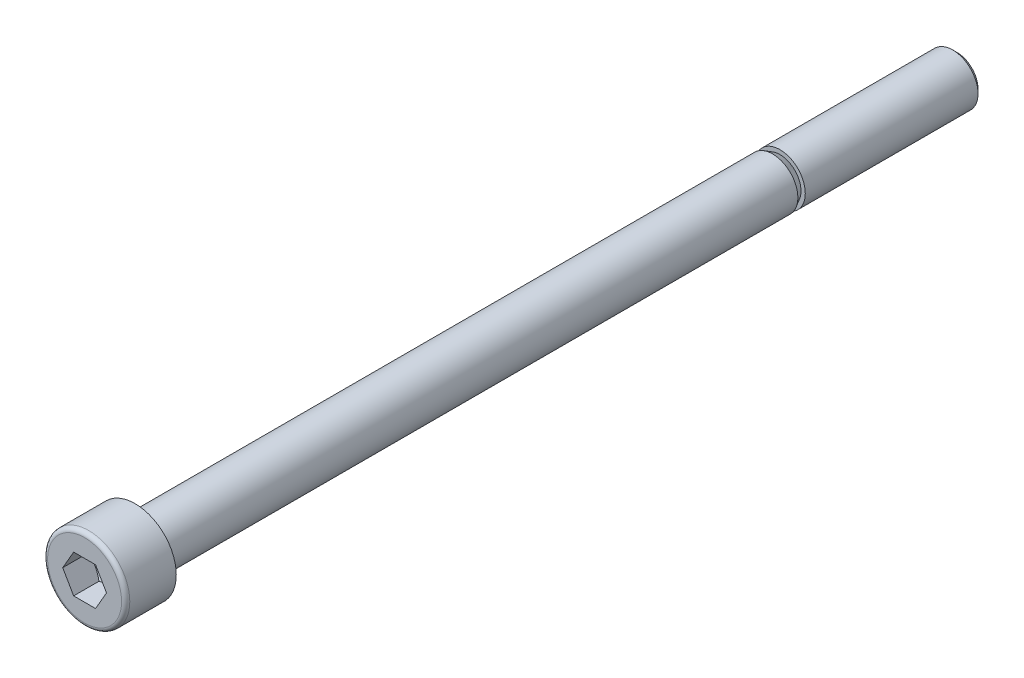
ISO-10303-21;
HEADER;
FILE_DESCRIPTION(('STEP AP214'),'2;1');
FILE_NAME('part.step','',(''),(''),'','','');
FILE_SCHEMA(('AUTOMOTIVE_DESIGN { 1 0 10303 214 1 1 1 1 }'));
ENDSEC;
DATA;
#1=APPLICATION_CONTEXT('core data for automotive mechanical design processes');
#2=APPLICATION_PROTOCOL_DEFINITION('international standard','automotive_design',2000,#1);
#3=PRODUCT_CONTEXT('',#1,'mechanical');
#4=PRODUCT('Part','Part','',(#3));
#5=PRODUCT_RELATED_PRODUCT_CATEGORY('part','',(#4));
#6=PRODUCT_DEFINITION_FORMATION('','',#4);
#7=PRODUCT_DEFINITION_CONTEXT('part definition',#1,'design');
#8=PRODUCT_DEFINITION('design','',#6,#7);
#9=PRODUCT_DEFINITION_SHAPE('','',#8);
#10=(LENGTH_UNIT() NAMED_UNIT(*) SI_UNIT(.MILLI.,.METRE.));
#11=(NAMED_UNIT(*) PLANE_ANGLE_UNIT() SI_UNIT($,.RADIAN.));
#12=(NAMED_UNIT(*) SI_UNIT($,.STERADIAN.) SOLID_ANGLE_UNIT());
#13=UNCERTAINTY_MEASURE_WITH_UNIT(LENGTH_MEASURE(1.E-05),#10,'distance_accuracy_value','');
#14=(GEOMETRIC_REPRESENTATION_CONTEXT(3) GLOBAL_UNCERTAINTY_ASSIGNED_CONTEXT((#13)) GLOBAL_UNIT_ASSIGNED_CONTEXT((#10,
#11,#12)) REPRESENTATION_CONTEXT('',''));
#15=CARTESIAN_POINT('',(0.,0.,0.));
#16=DIRECTION('',(0.,0.,1.));
#17=DIRECTION('',(1.,0.,0.));
#18=AXIS2_PLACEMENT_3D('',#15,#16,#17);
#19=CARTESIAN_POINT('',(0.,0.,8.00000000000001));
#20=DIRECTION('',(0.,0.,0.999999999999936));
#21=DIRECTION('',(1.,0.,0.));
#22=AXIS2_PLACEMENT_3D('',#19,#20,#21);
#23=PLANE('',#22);
#24=CARTESIAN_POINT('',(0.,0.,8.00000000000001));
#25=DIRECTION('',(0.,0.,0.999999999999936));
#26=DIRECTION('',(1.,0.,0.));
#27=AXIS2_PLACEMENT_3D('',#24,#25,#26);
#28=CIRCLE('',#27,5.85);
#29=CARTESIAN_POINT('',(5.85000000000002,0.,8.00000000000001));
#30=VERTEX_POINT('',#29);
#31=EDGE_CURVE('E13',#30,#30,#28,.T.);
#32=ORIENTED_EDGE('',*,*,#31,.T.);
#33=EDGE_LOOP('',(#32));
#34=FACE_BOUND('',#33,.T.);
#35=DIRECTION('',(1.,0.,0.));
#36=VECTOR('',#35,1.);
#37=CARTESIAN_POINT('',(-1.73204999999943,2.99999860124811,8.00000000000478));
#38=LINE('',#37,#36);
#39=CARTESIAN_POINT('',(-1.73204999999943,2.99999860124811,8.00000000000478));
#40=VERTEX_POINT('',#39);
#41=CARTESIAN_POINT('',(1.73205000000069,2.99999860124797,7.99999999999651));
#42=VERTEX_POINT('',#41);
#43=EDGE_CURVE('E100',#40,#42,#38,.T.);
#44=ORIENTED_EDGE('',*,*,#43,.T.);
#45=DIRECTION('',(0.5,-0.866025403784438,0.));
#46=VECTOR('',#45,1.);
#47=CARTESIAN_POINT('',(1.73205000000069,2.99999860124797,7.99999999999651));
#48=LINE('',#47,#46);
#49=CARTESIAN_POINT('',(3.46410000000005,-2.35922392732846E-13,8.00000000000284));
#50=VERTEX_POINT('',#49);
#51=EDGE_CURVE('E39',#42,#50,#48,.T.);
#52=ORIENTED_EDGE('',*,*,#51,.T.);
#53=DIRECTION('',(-0.500000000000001,-0.86602540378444,0.));
#54=VECTOR('',#53,1.);
#55=CARTESIAN_POINT('',(3.46410000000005,-2.35922392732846E-13,8.00000000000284));
#56=LINE('',#55,#54);
#57=CARTESIAN_POINT('',(1.73205000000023,-2.99999860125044,8.00000000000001));
#58=VERTEX_POINT('',#57);
#59=EDGE_CURVE('E177',#50,#58,#56,.T.);
#60=ORIENTED_EDGE('',*,*,#59,.T.);
#61=DIRECTION('',(-1.,0.,0.));
#62=VECTOR('',#61,1.);
#63=CARTESIAN_POINT('',(1.73205000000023,-2.99999860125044,8.00000000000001));
#64=LINE('',#63,#62);
#65=CARTESIAN_POINT('',(-1.73205000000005,-2.99999860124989,8.00000000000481));
#66=VERTEX_POINT('',#65);
#67=EDGE_CURVE('E173',#58,#66,#64,.T.);
#68=ORIENTED_EDGE('',*,*,#67,.T.);
#69=DIRECTION('',(-0.5,0.866025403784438,0.));
#70=VECTOR('',#69,1.);
#71=CARTESIAN_POINT('',(-1.73205000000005,-2.99999860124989,8.00000000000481));
#72=LINE('',#71,#70);
#73=CARTESIAN_POINT('',(-3.46410000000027,0.,7.99999999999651));
#74=VERTEX_POINT('',#73);
#75=EDGE_CURVE('E168',#66,#74,#72,.T.);
#76=ORIENTED_EDGE('',*,*,#75,.T.);
#77=DIRECTION('',(0.500000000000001,0.86602540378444,0.));
#78=VECTOR('',#77,1.);
#79=CARTESIAN_POINT('',(-3.46410000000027,0.,7.99999999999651));
#80=LINE('',#79,#78);
#81=EDGE_CURVE('E104',#74,#40,#80,.T.);
#82=ORIENTED_EDGE('',*,*,#81,.T.);
#83=EDGE_LOOP('',(#44,#52,#60,#68,#76,#82));
#84=FACE_BOUND('',#83,.T.);
#85=ADVANCED_FACE('F25',(#34,#84),#23,.T.);
#86=CARTESIAN_POINT('',(-1.11022302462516E-13,-4.71844785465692E-13,7.35));
#87=DIRECTION('',(0.,0.,0.999999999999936));
#88=DIRECTION('',(1.,0.,0.));
#89=AXIS2_PLACEMENT_3D('',#86,#87,#88);
#90=TOROIDAL_SURFACE('',#89,5.85,0.65);
#91=ORIENTED_EDGE('',*,*,#31,.F.);
#92=EDGE_LOOP('',(#91));
#93=FACE_BOUND('',#92,.T.);
#94=CARTESIAN_POINT('',(-1.11022302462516E-13,-4.71844785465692E-13,7.35));
#95=DIRECTION('',(0.,0.,0.999999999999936));
#96=DIRECTION('',(1.,0.,0.));
#97=AXIS2_PLACEMENT_3D('',#94,#95,#96);
#98=CIRCLE('',#97,6.5);
#99=CARTESIAN_POINT('',(6.50000000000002,0.,7.35));
#100=VERTEX_POINT('',#99);
#101=EDGE_CURVE('E32',#100,#100,#98,.T.);
#102=ORIENTED_EDGE('',*,*,#101,.T.);
#103=EDGE_LOOP('',(#102));
#104=FACE_BOUND('',#103,.T.);
#105=ADVANCED_FACE('F141',(#93,#104),#90,.T.);
#106=CARTESIAN_POINT('',(0.,0.,8.00000000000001));
#107=DIRECTION('',(0.,0.,0.999999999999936));
#108=DIRECTION('',(1.,0.,0.));
#109=AXIS2_PLACEMENT_3D('',#106,#107,#108);
#110=CYLINDRICAL_SURFACE('',#109,6.5);
#111=CARTESIAN_POINT('',(0.,0.,0.));
#112=DIRECTION('',(0.,0.,0.999999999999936));
#113=DIRECTION('',(1.,0.,0.));
#114=AXIS2_PLACEMENT_3D('',#111,#112,#113);
#115=CIRCLE('',#114,6.5);
#116=CARTESIAN_POINT('',(6.50000000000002,0.,0.));
#117=VERTEX_POINT('',#116);
#118=EDGE_CURVE('E136',#117,#117,#115,.T.);
#119=CARTESIAN_POINT('',(6.50000000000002,0.,0.));
#120=CARTESIAN_POINT('',(6.50000000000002,0.,0.0765625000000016));
#121=CARTESIAN_POINT('',(6.50000000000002,0.,0.153125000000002));
#122=CARTESIAN_POINT('',(6.50000000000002,0.,0.306250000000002));
#123=CARTESIAN_POINT('',(6.50000000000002,0.,0.382812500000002));
#124=CARTESIAN_POINT('',(6.50000000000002,0.,0.535937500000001));
#125=CARTESIAN_POINT('',(6.50000000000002,0.,0.612500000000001));
#126=CARTESIAN_POINT('',(6.50000000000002,0.,0.765625));
#127=CARTESIAN_POINT('',(6.50000000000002,0.,0.8421875));
#128=CARTESIAN_POINT('',(6.50000000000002,0.,0.9953125));
#129=CARTESIAN_POINT('',(6.50000000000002,0.,1.071875));
#130=CARTESIAN_POINT('',(6.50000000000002,0.,1.225));
#131=CARTESIAN_POINT('',(6.50000000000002,0.,1.3015625));
#132=CARTESIAN_POINT('',(6.50000000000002,0.,1.4546875));
#133=CARTESIAN_POINT('',(6.50000000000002,0.,1.53125));
#134=CARTESIAN_POINT('',(6.50000000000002,0.,1.684375));
#135=CARTESIAN_POINT('',(6.50000000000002,0.,1.7609375));
#136=CARTESIAN_POINT('',(6.50000000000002,0.,1.9140625));
#137=CARTESIAN_POINT('',(6.50000000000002,0.,1.990625));
#138=CARTESIAN_POINT('',(6.50000000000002,0.,2.14375));
#139=CARTESIAN_POINT('',(6.50000000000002,0.,2.2203125));
#140=CARTESIAN_POINT('',(6.50000000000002,0.,2.3734375));
#141=CARTESIAN_POINT('',(6.50000000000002,0.,2.45));
#142=CARTESIAN_POINT('',(6.50000000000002,0.,2.603125));
#143=CARTESIAN_POINT('',(6.50000000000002,0.,2.6796875));
#144=CARTESIAN_POINT('',(6.50000000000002,0.,2.8328125));
#145=CARTESIAN_POINT('',(6.50000000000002,0.,2.909375));
#146=CARTESIAN_POINT('',(6.50000000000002,0.,3.0625));
#147=CARTESIAN_POINT('',(6.50000000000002,0.,3.1390625));
#148=CARTESIAN_POINT('',(6.50000000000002,0.,3.2921875));
#149=CARTESIAN_POINT('',(6.50000000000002,0.,3.36875));
#150=CARTESIAN_POINT('',(6.50000000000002,0.,3.521875));
#151=CARTESIAN_POINT('',(6.50000000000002,0.,3.5984375));
#152=CARTESIAN_POINT('',(6.50000000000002,0.,3.7515625));
#153=CARTESIAN_POINT('',(6.50000000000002,0.,3.828125));
#154=CARTESIAN_POINT('',(6.50000000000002,0.,3.98125));
#155=CARTESIAN_POINT('',(6.50000000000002,0.,4.0578125));
#156=CARTESIAN_POINT('',(6.50000000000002,0.,4.2109375));
#157=CARTESIAN_POINT('',(6.50000000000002,0.,4.2875));
#158=CARTESIAN_POINT('',(6.50000000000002,0.,4.440625));
#159=CARTESIAN_POINT('',(6.50000000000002,0.,4.5171875));
#160=CARTESIAN_POINT('',(6.50000000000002,0.,4.6703125));
#161=CARTESIAN_POINT('',(6.50000000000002,0.,4.746875));
#162=CARTESIAN_POINT('',(6.50000000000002,0.,4.9));
#163=CARTESIAN_POINT('',(6.50000000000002,0.,4.9765625));
#164=CARTESIAN_POINT('',(6.50000000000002,0.,5.1296875));
#165=CARTESIAN_POINT('',(6.50000000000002,0.,5.20625));
#166=CARTESIAN_POINT('',(6.50000000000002,0.,5.359375));
#167=CARTESIAN_POINT('',(6.50000000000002,0.,5.4359375));
#168=CARTESIAN_POINT('',(6.50000000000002,0.,5.5890625));
#169=CARTESIAN_POINT('',(6.50000000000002,0.,5.665625));
#170=CARTESIAN_POINT('',(6.50000000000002,0.,5.81875));
#171=CARTESIAN_POINT('',(6.50000000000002,0.,5.8953125));
#172=CARTESIAN_POINT('',(6.50000000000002,0.,6.0484375));
#173=CARTESIAN_POINT('',(6.50000000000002,0.,6.125));
#174=CARTESIAN_POINT('',(6.50000000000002,0.,6.278125));
#175=CARTESIAN_POINT('',(6.50000000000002,0.,6.3546875));
#176=CARTESIAN_POINT('',(6.50000000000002,0.,6.5078125));
#177=CARTESIAN_POINT('',(6.50000000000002,0.,6.584375));
#178=CARTESIAN_POINT('',(6.50000000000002,0.,6.7375));
#179=CARTESIAN_POINT('',(6.50000000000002,0.,6.8140625));
#180=CARTESIAN_POINT('',(6.50000000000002,0.,6.9671875));
#181=CARTESIAN_POINT('',(6.50000000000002,0.,7.04375));
#182=CARTESIAN_POINT('',(6.50000000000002,0.,7.196875));
#183=CARTESIAN_POINT('',(6.50000000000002,0.,7.2734375));
#184=CARTESIAN_POINT('',(6.50000000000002,0.,7.35));
#185=B_SPLINE_CURVE_WITH_KNOTS('',3,(#119,#120,#121,#122,#123,#124,#125,#126,#127,#128,#129,
#130,#131,#132,#133,#134,#135,#136,#137,#138,#139,#140,#141,#142,#143,#144,#145,#146,#147,#148,
#149,#150,#151,#152,#153,#154,#155,#156,#157,#158,#159,#160,#161,#162,#163,#164,#165,#166,#167,
#168,#169,#170,#171,#172,#173,#174,#175,#176,#177,#178,#179,#180,#181,#182,#183,#184),
.UNSPECIFIED.,.F.,.F.,(4,2,2,2,2,2,2,2,2,2,2,2,2,2,2,2,2,2,2,2,2,2,2,2,2,2,2,2,2,2,2,2,4),(0.,
0.2296875,0.459375,0.689062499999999,0.918749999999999,1.1484375,1.378125,1.6078125,1.8375,
2.0671875,2.296875,2.5265625,2.75625,2.9859375,3.215625,3.4453125,3.675,3.9046875,4.134375,
4.3640625,4.59375,4.8234375,5.053125,5.2828125,5.5125,5.7421875,5.97187499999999,6.2015625,
6.43125,6.66093749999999,6.89062499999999,7.12031249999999,7.34999999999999),.UNSPECIFIED.);
#186=EDGE_CURVE('BSEAM143',#117,#100,#185,.T.);
#187=ORIENTED_EDGE('',*,*,#118,.T.);
#188=ORIENTED_EDGE('',*,*,#101,.F.);
#189=ORIENTED_EDGE('',*,*,#186,.T.);
#190=ORIENTED_EDGE('',*,*,#186,.F.);
#191=EDGE_LOOP('',(#187,#189,#188,#190));
#192=FACE_BOUND('',#191,.T.);
#193=ADVANCED_FACE('F143',(#192),#110,.T.);
#194=CARTESIAN_POINT('',(-1.38777878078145E-13,6.49999999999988,0.));
#195=DIRECTION('',(0.,0.,-0.999999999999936));
#196=DIRECTION('',(-1.,0.,0.));
#197=AXIS2_PLACEMENT_3D('',#194,#195,#196);
#198=PLANE('',#197);
#199=CARTESIAN_POINT('',(0.,0.,0.));
#200=DIRECTION('',(0.,0.,0.999999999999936));
#201=DIRECTION('',(1.,0.,0.));
#202=AXIS2_PLACEMENT_3D('',#199,#200,#201);
#203=CIRCLE('',#202,4.4);
#204=CARTESIAN_POINT('',(4.4,0.,0.));
#205=VERTEX_POINT('',#204);
#206=EDGE_CURVE('E133',#205,#205,#203,.T.);
#207=ORIENTED_EDGE('',*,*,#206,.T.);
#208=EDGE_LOOP('',(#207));
#209=FACE_BOUND('',#208,.T.);
#210=ORIENTED_EDGE('',*,*,#118,.F.);
#211=EDGE_LOOP('',(#210));
#212=FACE_BOUND('',#211,.T.);
#213=ADVANCED_FACE('F145',(#209,#212),#198,.T.);
#214=CARTESIAN_POINT('',(0.,0.,-0.400000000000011));
#215=DIRECTION('',(0.,0.,0.999999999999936));
#216=DIRECTION('',(1.,0.,0.));
#217=AXIS2_PLACEMENT_3D('',#214,#215,#216);
#218=TOROIDAL_SURFACE('',#217,4.4,0.4);
#219=CARTESIAN_POINT('',(0.,0.,-0.400000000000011));
#220=DIRECTION('',(0.,0.,0.999999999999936));
#221=DIRECTION('',(1.,0.,0.));
#222=AXIS2_PLACEMENT_3D('',#219,#220,#221);
#223=CIRCLE('',#222,4.);
#224=CARTESIAN_POINT('',(4.00000000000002,0.,-0.400000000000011));
#225=VERTEX_POINT('',#224);
#226=EDGE_CURVE('E130',#225,#225,#223,.T.);
#227=ORIENTED_EDGE('',*,*,#226,.T.);
#228=EDGE_LOOP('',(#227));
#229=FACE_BOUND('',#228,.T.);
#230=ORIENTED_EDGE('',*,*,#206,.F.);
#231=EDGE_LOOP('',(#230));
#232=FACE_BOUND('',#231,.T.);
#233=ADVANCED_FACE('F153',(#229,#232),#218,.F.);
#234=CARTESIAN_POINT('',(0.,0.,8.00000000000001));
#235=DIRECTION('',(0.,0.,0.999999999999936));
#236=DIRECTION('',(1.,0.,0.));
#237=AXIS2_PLACEMENT_3D('',#234,#235,#236);
#238=CYLINDRICAL_SURFACE('',#237,4.);
#239=CARTESIAN_POINT('',(-2.08166817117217E-13,-6.80011602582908E-13,-100.828159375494));
#240=DIRECTION('',(0.,0.,0.999999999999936));
#241=DIRECTION('',(1.,0.,0.));
#242=AXIS2_PLACEMENT_3D('',#239,#240,#241);
#243=CIRCLE('',#242,4.);
#244=CARTESIAN_POINT('',(4.00000000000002,0.,-100.828159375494));
#245=VERTEX_POINT('',#244);
#246=EDGE_CURVE('E127',#245,#245,#243,.T.);
#247=CARTESIAN_POINT('',(4.00000000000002,0.,-100.828159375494));
#248=CARTESIAN_POINT('',(4.00000000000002,0.,-99.7820327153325));
#249=CARTESIAN_POINT('',(4.00000000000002,0.,-98.7359060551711));
#250=CARTESIAN_POINT('',(4.00000000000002,0.,-96.6436527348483));
#251=CARTESIAN_POINT('',(4.00000000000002,0.,-95.5975260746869));
#252=CARTESIAN_POINT('',(4.00000000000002,0.,-93.5052727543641));
#253=CARTESIAN_POINT('',(4.00000000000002,0.,-92.4591460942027));
#254=CARTESIAN_POINT('',(4.00000000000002,0.,-90.3668927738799));
#255=CARTESIAN_POINT('',(4.00000000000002,0.,-89.3207661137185));
#256=CARTESIAN_POINT('',(4.00000000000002,0.,-87.2285127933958));
#257=CARTESIAN_POINT('',(4.00000000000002,0.,-86.1823861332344));
#258=CARTESIAN_POINT('',(4.00000000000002,0.,-84.0901328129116));
#259=CARTESIAN_POINT('',(4.00000000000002,0.,-83.0440061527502));
#260=CARTESIAN_POINT('',(4.00000000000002,0.,-80.9517528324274));
#261=CARTESIAN_POINT('',(4.00000000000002,0.,-79.905626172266));
#262=CARTESIAN_POINT('',(4.00000000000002,0.,-77.8133728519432));
#263=CARTESIAN_POINT('',(4.00000000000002,0.,-76.7672461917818));
#264=CARTESIAN_POINT('',(4.00000000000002,0.,-74.674992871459));
#265=CARTESIAN_POINT('',(4.00000000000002,0.,-73.6288662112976));
#266=CARTESIAN_POINT('',(4.00000000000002,0.,-71.5366128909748));
#267=CARTESIAN_POINT('',(4.00000000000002,0.,-70.4904862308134));
#268=CARTESIAN_POINT('',(4.00000000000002,0.,-68.3982329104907));
#269=CARTESIAN_POINT('',(4.00000000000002,0.,-67.3521062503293));
#270=CARTESIAN_POINT('',(4.00000000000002,0.,-65.2598529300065));
#271=CARTESIAN_POINT('',(4.00000000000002,0.,-64.2137262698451));
#272=CARTESIAN_POINT('',(4.00000000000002,0.,-62.1214729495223));
#273=CARTESIAN_POINT('',(4.00000000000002,0.,-61.0753462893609));
#274=CARTESIAN_POINT('',(4.00000000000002,0.,-58.9830929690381));
#275=CARTESIAN_POINT('',(4.00000000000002,0.,-57.9369663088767));
#276=CARTESIAN_POINT('',(4.00000000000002,0.,-55.8447129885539));
#277=CARTESIAN_POINT('',(4.00000000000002,0.,-54.7985863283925));
#278=CARTESIAN_POINT('',(4.00000000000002,0.,-52.7063330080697));
#279=CARTESIAN_POINT('',(4.00000000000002,0.,-51.6602063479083));
#280=CARTESIAN_POINT('',(4.00000000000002,0.,-49.5679530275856));
#281=CARTESIAN_POINT('',(4.00000000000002,0.,-48.5218263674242));
#282=CARTESIAN_POINT('',(4.00000000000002,0.,-46.4295730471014));
#283=CARTESIAN_POINT('',(4.00000000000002,0.,-45.38344638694));
#284=CARTESIAN_POINT('',(4.00000000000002,0.,-43.2911930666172));
#285=CARTESIAN_POINT('',(4.00000000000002,0.,-42.2450664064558));
#286=CARTESIAN_POINT('',(4.00000000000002,0.,-40.152813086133));
#287=CARTESIAN_POINT('',(4.00000000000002,0.,-39.1066864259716));
#288=CARTESIAN_POINT('',(4.00000000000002,0.,-37.0144331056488));
#289=CARTESIAN_POINT('',(4.00000000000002,0.,-35.9683064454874));
#290=CARTESIAN_POINT('',(4.00000000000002,0.,-33.8760531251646));
#291=CARTESIAN_POINT('',(4.00000000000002,0.,-32.8299264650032));
#292=CARTESIAN_POINT('',(4.00000000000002,0.,-30.7376731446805));
#293=CARTESIAN_POINT('',(4.00000000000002,0.,-29.6915464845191));
#294=CARTESIAN_POINT('',(4.00000000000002,0.,-27.5992931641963));
#295=CARTESIAN_POINT('',(4.00000000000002,0.,-26.5531665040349));
#296=CARTESIAN_POINT('',(4.00000000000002,0.,-24.4609131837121));
#297=CARTESIAN_POINT('',(4.00000000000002,0.,-23.4147865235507));
#298=CARTESIAN_POINT('',(4.00000000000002,0.,-21.3225332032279));
#299=CARTESIAN_POINT('',(4.00000000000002,0.,-20.2764065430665));
#300=CARTESIAN_POINT('',(4.00000000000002,0.,-18.1841532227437));
#301=CARTESIAN_POINT('',(4.00000000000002,0.,-17.1380265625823));
#302=CARTESIAN_POINT('',(4.00000000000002,0.,-15.0457732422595));
#303=CARTESIAN_POINT('',(4.00000000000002,0.,-13.9996465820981));
#304=CARTESIAN_POINT('',(4.00000000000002,0.,-11.9073932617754));
#305=CARTESIAN_POINT('',(4.00000000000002,0.,-10.861266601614));
#306=CARTESIAN_POINT('',(4.00000000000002,0.,-8.76901328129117));
#307=CARTESIAN_POINT('',(4.00000000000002,0.,-7.72288662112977));
#308=CARTESIAN_POINT('',(4.00000000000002,0.,-5.63063330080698));
#309=CARTESIAN_POINT('',(4.00000000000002,0.,-4.58450664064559));
#310=CARTESIAN_POINT('',(4.00000000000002,0.,-2.4922533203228));
#311=CARTESIAN_POINT('',(4.00000000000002,0.,-1.4461266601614));
#312=CARTESIAN_POINT('',(4.00000000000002,0.,-0.400000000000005));
#313=B_SPLINE_CURVE_WITH_KNOTS('',3,(#247,#248,#249,#250,#251,#252,#253,#254,#255,#256,#257,
#258,#259,#260,#261,#262,#263,#264,#265,#266,#267,#268,#269,#270,#271,#272,#273,#274,#275,#276,
#277,#278,#279,#280,#281,#282,#283,#284,#285,#286,#287,#288,#289,#290,#291,#292,#293,#294,#295,
#296,#297,#298,#299,#300,#301,#302,#303,#304,#305,#306,#307,#308,#309,#310,#311,#312),
.UNSPECIFIED.,.F.,.F.,(4,2,2,2,2,2,2,2,2,2,2,2,2,2,2,2,2,2,2,2,2,2,2,2,2,2,2,2,2,2,2,2,4),(0.,
3.13837998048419,6.27675996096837,9.41513994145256,12.5535199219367,15.6918999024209,
18.8302798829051,21.9686598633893,25.1070398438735,28.2454198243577,31.3837998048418,
34.522179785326,37.6605597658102,40.7989397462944,43.9373197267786,47.0756997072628,
50.2140796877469,53.3524596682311,56.4908396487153,59.6292196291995,62.7675996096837,
65.9059795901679,69.044359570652,72.1827395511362,75.3211195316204,78.4594995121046,
81.5978794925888,84.736259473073,87.8746394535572,91.0130194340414,94.1513994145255,
97.2897793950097,100.428159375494),.UNSPECIFIED.);
#314=EDGE_CURVE('BSEAM276',#245,#225,#313,.T.);
#315=ORIENTED_EDGE('',*,*,#246,.T.);
#316=ORIENTED_EDGE('',*,*,#226,.F.);
#317=ORIENTED_EDGE('',*,*,#314,.T.);
#318=ORIENTED_EDGE('',*,*,#314,.F.);
#319=EDGE_LOOP('',(#315,#317,#316,#318));
#320=FACE_BOUND('',#319,.T.);
#321=ADVANCED_FACE('F276',(#320),#238,.T.);
#322=CARTESIAN_POINT('',(-2.08166817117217E-13,-6.80011602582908E-13,-100.828159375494));
#323=DIRECTION('',(0.,0.,0.999999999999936));
#324=DIRECTION('',(1.,0.,0.));
#325=AXIS2_PLACEMENT_3D('',#322,#323,#324);
#326=CONICAL_SURFACE('',#325,4.,0.523598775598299);
#327=CARTESIAN_POINT('',(4.71844785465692E-13,-1.20736753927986E-12,-101.99999999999));
#328=DIRECTION('',(0.,0.,0.999999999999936));
#329=DIRECTION('',(1.,0.,0.));
#330=AXIS2_PLACEMENT_3D('',#327,#328,#329);
#331=CIRCLE('',#330,3.3234375);
#332=CARTESIAN_POINT('',(3.32343749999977,-6.77982236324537E-13,-101.99999999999));
#333=VERTEX_POINT('',#332);
#334=EDGE_CURVE('E124',#333,#333,#331,.T.);
#335=CARTESIAN_POINT('',(3.32343749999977,-6.77982236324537E-13,-101.99999999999));
#336=CARTESIAN_POINT('',(3.33048502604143,-6.77977932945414E-13,-101.987793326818));
#337=CARTESIAN_POINT('',(3.3375325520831,-6.77973629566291E-13,-101.975586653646));
#338=CARTESIAN_POINT('',(3.35162760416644,-6.77965022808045E-13,-101.951173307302));
#339=CARTESIAN_POINT('',(3.35867513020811,-6.77960719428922E-13,-101.938966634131));
#340=CARTESIAN_POINT('',(3.37277018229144,-6.77952112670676E-13,-101.914553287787));
#341=CARTESIAN_POINT('',(3.3798177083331,-6.77947809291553E-13,-101.902346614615));
#342=CARTESIAN_POINT('',(3.39391276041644,-6.77939202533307E-13,-101.877933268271));
#343=CARTESIAN_POINT('',(3.40096028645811,-6.77934899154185E-13,-101.8657265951));
#344=CARTESIAN_POINT('',(3.41505533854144,-6.77926292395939E-13,-101.841313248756));
#345=CARTESIAN_POINT('',(3.4221028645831,-6.77921989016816E-13,-101.829106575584));
#346=CARTESIAN_POINT('',(3.43619791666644,-6.7791338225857E-13,-101.80469322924));
#347=CARTESIAN_POINT('',(3.44324544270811,-6.77909078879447E-13,-101.792486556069));
#348=CARTESIAN_POINT('',(3.45734049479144,-6.77900472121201E-13,-101.768073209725));
#349=CARTESIAN_POINT('',(3.46438802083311,-6.77896168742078E-13,-101.755866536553));
#350=CARTESIAN_POINT('',(3.47848307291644,-6.77887561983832E-13,-101.731453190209));
#351=CARTESIAN_POINT('',(3.48553059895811,-6.77883258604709E-13,-101.719246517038));
#352=CARTESIAN_POINT('',(3.49962565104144,-6.77874651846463E-13,-101.694833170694));
#353=CARTESIAN_POINT('',(3.50667317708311,-6.7787034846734E-13,-101.682626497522));
#354=CARTESIAN_POINT('',(3.52076822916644,-6.77861741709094E-13,-101.658213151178));
#355=CARTESIAN_POINT('',(3.52781575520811,-6.77857438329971E-13,-101.646006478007));
#356=CARTESIAN_POINT('',(3.54191080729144,-6.77848831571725E-13,-101.621593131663));
#357=CARTESIAN_POINT('',(3.54895833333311,-6.77844528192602E-13,-101.609386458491));
#358=CARTESIAN_POINT('',(3.56305338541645,-6.77835921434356E-13,-101.584973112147));
#359=CARTESIAN_POINT('',(3.57010091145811,-6.77831618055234E-13,-101.572766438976));
#360=CARTESIAN_POINT('',(3.58419596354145,-6.77823011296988E-13,-101.548353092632));
#361=CARTESIAN_POINT('',(3.59124348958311,-6.77818707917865E-13,-101.53614641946));
#362=CARTESIAN_POINT('',(3.60533854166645,-6.77810101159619E-13,-101.511733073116));
#363=CARTESIAN_POINT('',(3.61238606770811,-6.77805797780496E-13,-101.499526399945));
#364=CARTESIAN_POINT('',(3.62648111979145,-6.7779719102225E-13,-101.475113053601));
#365=CARTESIAN_POINT('',(3.63352864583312,-6.77792887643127E-13,-101.462906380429));
#366=CARTESIAN_POINT('',(3.64762369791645,-6.77784280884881E-13,-101.438493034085));
#367=CARTESIAN_POINT('',(3.65467122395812,-6.77779977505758E-13,-101.426286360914));
#368=CARTESIAN_POINT('',(3.66876627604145,-6.77771370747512E-13,-101.40187301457));
#369=CARTESIAN_POINT('',(3.67581380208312,-6.77767067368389E-13,-101.389666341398));
#370=CARTESIAN_POINT('',(3.68990885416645,-6.77758460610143E-13,-101.365252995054));
#371=CARTESIAN_POINT('',(3.69695638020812,-6.7775415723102E-13,-101.353046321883));
#372=CARTESIAN_POINT('',(3.71105143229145,-6.77745550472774E-13,-101.328632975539));
#373=CARTESIAN_POINT('',(3.71809895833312,-6.77741247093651E-13,-101.316426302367));
#374=CARTESIAN_POINT('',(3.73219401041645,-6.77732640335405E-13,-101.292012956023));
#375=CARTESIAN_POINT('',(3.73924153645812,-6.77728336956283E-13,-101.279806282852));
#376=CARTESIAN_POINT('',(3.75333658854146,-6.77719730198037E-13,-101.255392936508));
#377=CARTESIAN_POINT('',(3.76038411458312,-6.77715426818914E-13,-101.243186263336));
#378=CARTESIAN_POINT('',(3.77447916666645,-6.77706820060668E-13,-101.218772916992));
#379=CARTESIAN_POINT('',(3.78152669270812,-6.77702516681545E-13,-101.206566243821));
#380=CARTESIAN_POINT('',(3.79562174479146,-6.77693909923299E-13,-101.182152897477));
#381=CARTESIAN_POINT('',(3.80266927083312,-6.77689606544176E-13,-101.169946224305));
#382=CARTESIAN_POINT('',(3.81676432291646,-6.7768099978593E-13,-101.145532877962));
#383=CARTESIAN_POINT('',(3.82381184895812,-6.77676696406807E-13,-101.13332620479));
#384=CARTESIAN_POINT('',(3.83790690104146,-6.77668089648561E-13,-101.108912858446));
#385=CARTESIAN_POINT('',(3.84495442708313,-6.77663786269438E-13,-101.096706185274));
#386=CARTESIAN_POINT('',(3.85904947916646,-6.77655179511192E-13,-101.072292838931));
#387=CARTESIAN_POINT('',(3.86609700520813,-6.77650876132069E-13,-101.060086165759));
#388=CARTESIAN_POINT('',(3.88019205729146,-6.77642269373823E-13,-101.035672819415));
#389=CARTESIAN_POINT('',(3.88723958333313,-6.776379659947E-13,-101.023466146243));
#390=CARTESIAN_POINT('',(3.90133463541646,-6.77629359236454E-13,-100.9990527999));
#391=CARTESIAN_POINT('',(3.90838216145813,-6.77625055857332E-13,-100.986846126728));
#392=CARTESIAN_POINT('',(3.92247721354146,-6.77616449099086E-13,-100.962432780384));
#393=CARTESIAN_POINT('',(3.92952473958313,-6.77612145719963E-13,-100.950226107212));
#394=CARTESIAN_POINT('',(3.94361979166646,-6.77603538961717E-13,-100.925812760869));
#395=CARTESIAN_POINT('',(3.95066731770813,-6.77599235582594E-13,-100.913606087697));
#396=CARTESIAN_POINT('',(3.96476236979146,-6.77590628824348E-13,-100.889192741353));
#397=CARTESIAN_POINT('',(3.97180989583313,-6.77586325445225E-13,-100.876986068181));
#398=CARTESIAN_POINT('',(3.98590494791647,-6.77577718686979E-13,-100.852572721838));
#399=CARTESIAN_POINT('',(3.99295247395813,-6.77573415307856E-13,-100.840366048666));
#400=CARTESIAN_POINT('',(3.9999999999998,-6.77569111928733E-13,-100.828159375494));
#401=B_SPLINE_CURVE_WITH_KNOTS('',3,(#335,#336,#337,#338,#339,#340,#341,#342,#343,#344,#345,
#346,#347,#348,#349,#350,#351,#352,#353,#354,#355,#356,#357,#358,#359,#360,#361,#362,#363,#364,
#365,#366,#367,#368,#369,#370,#371,#372,#373,#374,#375,#376,#377,#378,#379,#380,#381,#382,#383,
#384,#385,#386,#387,#388,#389,#390,#391,#392,#393,#394,#395,#396,#397,#398,#399,#400),
.UNSPECIFIED.,.F.,.F.,(4,2,2,2,2,2,2,2,2,2,2,2,2,2,2,2,2,2,2,2,2,2,2,2,2,2,2,2,2,2,2,2,4),(0.,
0.0422851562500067,0.0845703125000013,0.126855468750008,0.169140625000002,0.211425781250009,
0.253710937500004,0.29599609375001,0.338281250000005,0.38056640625,0.422851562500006,
0.465136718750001,0.507421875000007,0.549707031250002,0.591992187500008,0.634277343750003,
0.676562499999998,0.718847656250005,0.761132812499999,0.803417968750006,0.845703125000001,
0.887988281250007,0.930273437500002,0.972558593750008,1.01484375,1.05712890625,1.0994140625,
1.14169921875,1.18398437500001,1.22626953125,1.26855468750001,1.31083984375,1.353125),.UNSPECIFIED.);
#402=EDGE_CURVE('BSEAM272',#333,#245,#401,.T.);
#403=ORIENTED_EDGE('',*,*,#334,.T.);
#404=ORIENTED_EDGE('',*,*,#246,.F.);
#405=ORIENTED_EDGE('',*,*,#402,.T.);
#406=ORIENTED_EDGE('',*,*,#402,.F.);
#407=EDGE_LOOP('',(#403,#405,#404,#406));
#408=FACE_BOUND('',#407,.T.);
#409=ADVANCED_FACE('F272',(#408),#326,.T.);
#410=CARTESIAN_POINT('',(8.74300631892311E-13,3.32343749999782,-101.99999999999));
#411=DIRECTION('',(0.,0.,0.999999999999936));
#412=DIRECTION('',(1.,0.,0.));
#413=AXIS2_PLACEMENT_3D('',#410,#411,#412);
#414=PLANE('',#413);
#415=CARTESIAN_POINT('',(4.71844785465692E-13,-1.20736753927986E-12,-101.99999999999));
#416=DIRECTION('',(0.,0.,0.999999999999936));
#417=DIRECTION('',(1.,0.,0.));
#418=AXIS2_PLACEMENT_3D('',#415,#416,#417);
#419=CIRCLE('',#418,4.);
#420=CARTESIAN_POINT('',(4.00000000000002,0.,-101.99999999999));
#421=VERTEX_POINT('',#420);
#422=EDGE_CURVE('E121',#421,#421,#419,.T.);
#423=ORIENTED_EDGE('',*,*,#422,.T.);
#424=EDGE_LOOP('',(#423));
#425=FACE_BOUND('',#424,.T.);
#426=ORIENTED_EDGE('',*,*,#334,.F.);
#427=EDGE_LOOP('',(#426));
#428=FACE_BOUND('',#427,.T.);
#429=ADVANCED_FACE('F268',(#425,#428),#414,.T.);
#430=CARTESIAN_POINT('',(0.,0.,8.00000000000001));
#431=DIRECTION('',(0.,0.,0.999999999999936));
#432=DIRECTION('',(1.,0.,0.));
#433=AXIS2_PLACEMENT_3D('',#430,#431,#432);
#434=CYLINDRICAL_SURFACE('',#433,4.);
#435=CARTESIAN_POINT('',(0.,-1.80411241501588E-13,-129.323437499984));
#436=DIRECTION('',(0.,0.,0.999999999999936));
#437=DIRECTION('',(1.,0.,0.));
#438=AXIS2_PLACEMENT_3D('',#435,#436,#437);
#439=CIRCLE('',#438,4.);
#440=CARTESIAN_POINT('',(4.00000000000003,0.,-129.323437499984));
#441=VERTEX_POINT('',#440);
#442=EDGE_CURVE('E118',#441,#441,#439,.T.);
#443=CARTESIAN_POINT('',(4.00000000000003,0.,-129.323437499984));
#444=CARTESIAN_POINT('',(4.00000000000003,0.,-129.038818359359));
#445=CARTESIAN_POINT('',(4.00000000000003,0.,-128.754199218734));
#446=CARTESIAN_POINT('',(4.00000000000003,0.,-128.184960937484));
#447=CARTESIAN_POINT('',(4.00000000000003,0.,-127.900341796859));
#448=CARTESIAN_POINT('',(4.00000000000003,0.,-127.331103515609));
#449=CARTESIAN_POINT('',(4.00000000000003,0.,-127.046484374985));
#450=CARTESIAN_POINT('',(4.00000000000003,0.,-126.477246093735));
#451=CARTESIAN_POINT('',(4.00000000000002,0.,-126.19262695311));
#452=CARTESIAN_POINT('',(4.00000000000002,0.,-125.62338867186));
#453=CARTESIAN_POINT('',(4.00000000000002,0.,-125.338769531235));
#454=CARTESIAN_POINT('',(4.00000000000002,0.,-124.769531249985));
#455=CARTESIAN_POINT('',(4.00000000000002,0.,-124.48491210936));
#456=CARTESIAN_POINT('',(4.00000000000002,0.,-123.91567382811));
#457=CARTESIAN_POINT('',(4.00000000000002,0.,-123.631054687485));
#458=CARTESIAN_POINT('',(4.00000000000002,0.,-123.061816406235));
#459=CARTESIAN_POINT('',(4.00000000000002,0.,-122.77719726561));
#460=CARTESIAN_POINT('',(4.00000000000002,0.,-122.207958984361));
#461=CARTESIAN_POINT('',(4.00000000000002,0.,-121.923339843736));
#462=CARTESIAN_POINT('',(4.00000000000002,0.,-121.354101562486));
#463=CARTESIAN_POINT('',(4.00000000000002,0.,-121.069482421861));
#464=CARTESIAN_POINT('',(4.00000000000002,0.,-120.500244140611));
#465=CARTESIAN_POINT('',(4.00000000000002,0.,-120.215624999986));
#466=CARTESIAN_POINT('',(4.00000000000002,0.,-119.646386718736));
#467=CARTESIAN_POINT('',(4.00000000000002,0.,-119.361767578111));
#468=CARTESIAN_POINT('',(4.00000000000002,0.,-118.792529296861));
#469=CARTESIAN_POINT('',(4.00000000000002,0.,-118.507910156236));
#470=CARTESIAN_POINT('',(4.00000000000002,0.,-117.938671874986));
#471=CARTESIAN_POINT('',(4.00000000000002,0.,-117.654052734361));
#472=CARTESIAN_POINT('',(4.00000000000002,0.,-117.084814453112));
#473=CARTESIAN_POINT('',(4.00000000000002,0.,-116.800195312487));
#474=CARTESIAN_POINT('',(4.00000000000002,0.,-116.230957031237));
#475=CARTESIAN_POINT('',(4.00000000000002,0.,-115.946337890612));
#476=CARTESIAN_POINT('',(4.00000000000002,0.,-115.377099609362));
#477=CARTESIAN_POINT('',(4.00000000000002,0.,-115.092480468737));
#478=CARTESIAN_POINT('',(4.00000000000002,0.,-114.523242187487));
#479=CARTESIAN_POINT('',(4.00000000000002,0.,-114.238623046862));
#480=CARTESIAN_POINT('',(4.00000000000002,0.,-113.669384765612));
#481=CARTESIAN_POINT('',(4.00000000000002,0.,-113.384765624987));
#482=CARTESIAN_POINT('',(4.00000000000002,0.,-112.815527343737));
#483=CARTESIAN_POINT('',(4.00000000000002,0.,-112.530908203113));
#484=CARTESIAN_POINT('',(4.00000000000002,0.,-111.961669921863));
#485=CARTESIAN_POINT('',(4.00000000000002,0.,-111.677050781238));
#486=CARTESIAN_POINT('',(4.00000000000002,0.,-111.107812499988));
#487=CARTESIAN_POINT('',(4.00000000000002,0.,-110.823193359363));
#488=CARTESIAN_POINT('',(4.00000000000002,0.,-110.253955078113));
#489=CARTESIAN_POINT('',(4.00000000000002,0.,-109.969335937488));
#490=CARTESIAN_POINT('',(4.00000000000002,0.,-109.400097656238));
#491=CARTESIAN_POINT('',(4.00000000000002,0.,-109.115478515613));
#492=CARTESIAN_POINT('',(4.00000000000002,0.,-108.546240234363));
#493=CARTESIAN_POINT('',(4.00000000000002,0.,-108.261621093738));
#494=CARTESIAN_POINT('',(4.00000000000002,0.,-107.692382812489));
#495=CARTESIAN_POINT('',(4.00000000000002,0.,-107.407763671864));
#496=CARTESIAN_POINT('',(4.00000000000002,0.,-106.838525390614));
#497=CARTESIAN_POINT('',(4.00000000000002,0.,-106.553906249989));
#498=CARTESIAN_POINT('',(4.00000000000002,0.,-105.984667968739));
#499=CARTESIAN_POINT('',(4.00000000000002,0.,-105.700048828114));
#500=CARTESIAN_POINT('',(4.00000000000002,0.,-105.130810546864));
#501=CARTESIAN_POINT('',(4.00000000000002,0.,-104.846191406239));
#502=CARTESIAN_POINT('',(4.00000000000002,0.,-104.276953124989));
#503=CARTESIAN_POINT('',(4.00000000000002,0.,-103.992333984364));
#504=CARTESIAN_POINT('',(4.00000000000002,0.,-103.423095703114));
#505=CARTESIAN_POINT('',(4.00000000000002,0.,-103.138476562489));
#506=CARTESIAN_POINT('',(4.00000000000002,0.,-102.56923828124));
#507=CARTESIAN_POINT('',(4.00000000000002,0.,-102.284619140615));
#508=CARTESIAN_POINT('',(4.00000000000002,0.,-101.99999999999));
#509=B_SPLINE_CURVE_WITH_KNOTS('',3,(#443,#444,#445,#446,#447,#448,#449,#450,#451,#452,#453,
#454,#455,#456,#457,#458,#459,#460,#461,#462,#463,#464,#465,#466,#467,#468,#469,#470,#471,#472,
#473,#474,#475,#476,#477,#478,#479,#480,#481,#482,#483,#484,#485,#486,#487,#488,#489,#490,#491,
#492,#493,#494,#495,#496,#497,#498,#499,#500,#501,#502,#503,#504,#505,#506,#507,#508),
.UNSPECIFIED.,.F.,.F.,(4,2,2,2,2,2,2,2,2,2,2,2,2,2,2,2,2,2,2,2,2,2,2,2,2,2,2,2,2,2,2,2,4),(0.,
0.853857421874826,1.70771484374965,2.56157226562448,3.41542968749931,4.26928710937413,
5.12314453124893,5.97700195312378,6.83085937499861,7.68471679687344,8.53857421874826,
9.39243164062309,10.2462890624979,11.1001464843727,11.9540039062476,12.8078613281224,
13.6617187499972,14.515576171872,15.3694335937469,16.2232910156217,17.0771484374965,
17.9310058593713,18.7848632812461,19.638720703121,20.4925781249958,21.3464355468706,
22.2002929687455,23.0541503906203,23.9080078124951,24.7618652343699,25.6157226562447,
26.4695800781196,27.3234374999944),.UNSPECIFIED.);
#510=EDGE_CURVE('BSEAM261',#441,#421,#509,.T.);
#511=ORIENTED_EDGE('',*,*,#442,.T.);
#512=ORIENTED_EDGE('',*,*,#422,.F.);
#513=ORIENTED_EDGE('',*,*,#510,.T.);
#514=ORIENTED_EDGE('',*,*,#510,.F.);
#515=EDGE_LOOP('',(#511,#513,#512,#514));
#516=FACE_BOUND('',#515,.T.);
#517=ADVANCED_FACE('F261',(#516),#434,.T.);
#518=CARTESIAN_POINT('',(0.,-1.80411241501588E-13,-129.323437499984));
#519=DIRECTION('',(0.,0.,0.999999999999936));
#520=DIRECTION('',(1.,0.,0.));
#521=AXIS2_PLACEMENT_3D('',#518,#519,#520);
#522=CONICAL_SURFACE('',#521,4.,0.785398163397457);
#523=CARTESIAN_POINT('',(0.,-1.80411241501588E-13,-129.999999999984));
#524=DIRECTION('',(0.,0.,0.999999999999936));
#525=DIRECTION('',(1.,0.,0.));
#526=AXIS2_PLACEMENT_3D('',#523,#524,#525);
#527=CIRCLE('',#526,3.3234375);
#528=CARTESIAN_POINT('',(3.32343749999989,-1.78381875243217E-13,-129.999999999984));
#529=VERTEX_POINT('',#528);
#530=EDGE_CURVE('E115',#529,#529,#527,.T.);
#531=CARTESIAN_POINT('',(3.32343749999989,-1.78381875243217E-13,-129.999999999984));
#532=CARTESIAN_POINT('',(3.33048502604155,-1.78377571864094E-13,-129.992952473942));
#533=CARTESIAN_POINT('',(3.33753255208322,-1.78373268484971E-13,-129.985904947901));
#534=CARTESIAN_POINT('',(3.35162760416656,-1.78364661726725E-13,-129.971809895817));
#535=CARTESIAN_POINT('',(3.35867513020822,-1.78360358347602E-13,-129.964762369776));
#536=CARTESIAN_POINT('',(3.37277018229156,-1.78351751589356E-13,-129.950667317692));
#537=CARTESIAN_POINT('',(3.37981770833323,-1.78347448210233E-13,-129.943619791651));
#538=CARTESIAN_POINT('',(3.39391276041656,-1.78338841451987E-13,-129.929524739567));
#539=CARTESIAN_POINT('',(3.40096028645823,-1.78334538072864E-13,-129.922477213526));
#540=CARTESIAN_POINT('',(3.41505533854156,-1.78325931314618E-13,-129.908382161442));
#541=CARTESIAN_POINT('',(3.42210286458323,-1.78321627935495E-13,-129.901334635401));
#542=CARTESIAN_POINT('',(3.43619791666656,-1.78313021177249E-13,-129.887239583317));
#543=CARTESIAN_POINT('',(3.44324544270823,-1.78308717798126E-13,-129.880192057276));
#544=CARTESIAN_POINT('',(3.45734049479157,-1.7830011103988E-13,-129.866097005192));
#545=CARTESIAN_POINT('',(3.46438802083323,-1.78295807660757E-13,-129.859049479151));
#546=CARTESIAN_POINT('',(3.47848307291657,-1.78287200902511E-13,-129.844954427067));
#547=CARTESIAN_POINT('',(3.48553059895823,-1.78282897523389E-13,-129.837906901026));
#548=CARTESIAN_POINT('',(3.49962565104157,-1.78274290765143E-13,-129.823811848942));
#549=CARTESIAN_POINT('',(3.50667317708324,-1.7826998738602E-13,-129.816764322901));
#550=CARTESIAN_POINT('',(3.52076822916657,-1.78261380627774E-13,-129.802669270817));
#551=CARTESIAN_POINT('',(3.52781575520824,-1.78257077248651E-13,-129.795621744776));
#552=CARTESIAN_POINT('',(3.54191080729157,-1.78248470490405E-13,-129.781526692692));
#553=CARTESIAN_POINT('',(3.54895833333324,-1.78244167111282E-13,-129.774479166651));
#554=CARTESIAN_POINT('',(3.56305338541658,-1.78235560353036E-13,-129.760384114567));
#555=CARTESIAN_POINT('',(3.57010091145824,-1.78231256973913E-13,-129.753336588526));
#556=CARTESIAN_POINT('',(3.58419596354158,-1.78222650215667E-13,-129.739241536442));
#557=CARTESIAN_POINT('',(3.59124348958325,-1.78218346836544E-13,-129.732194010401));
#558=CARTESIAN_POINT('',(3.60533854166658,-1.78209740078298E-13,-129.718098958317));
#559=CARTESIAN_POINT('',(3.61238606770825,-1.78205436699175E-13,-129.711051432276));
#560=CARTESIAN_POINT('',(3.62648111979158,-1.78196829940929E-13,-129.696956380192));
#561=CARTESIAN_POINT('',(3.63352864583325,-1.78192526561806E-13,-129.689908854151));
#562=CARTESIAN_POINT('',(3.64762369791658,-1.78183919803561E-13,-129.675813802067));
#563=CARTESIAN_POINT('',(3.65467122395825,-1.78179616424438E-13,-129.668766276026));
#564=CARTESIAN_POINT('',(3.66876627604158,-1.78171009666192E-13,-129.654671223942));
#565=CARTESIAN_POINT('',(3.67581380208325,-1.78166706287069E-13,-129.647623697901));
#566=CARTESIAN_POINT('',(3.68990885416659,-1.78158099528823E-13,-129.633528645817));
#567=CARTESIAN_POINT('',(3.69695638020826,-1.781537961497E-13,-129.626481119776));
#568=CARTESIAN_POINT('',(3.71105143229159,-1.78145189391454E-13,-129.612386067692));
#569=CARTESIAN_POINT('',(3.71809895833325,-1.78140886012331E-13,-129.605338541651));
#570=CARTESIAN_POINT('',(3.73219401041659,-1.78132279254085E-13,-129.591243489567));
#571=CARTESIAN_POINT('',(3.73924153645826,-1.78127975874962E-13,-129.584195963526));
#572=CARTESIAN_POINT('',(3.75333658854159,-1.78119369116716E-13,-129.570100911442));
#573=CARTESIAN_POINT('',(3.76038411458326,-1.78115065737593E-13,-129.563053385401));
#574=CARTESIAN_POINT('',(3.7744791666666,-1.78106458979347E-13,-129.548958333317));
#575=CARTESIAN_POINT('',(3.78152669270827,-1.78102155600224E-13,-129.541910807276));
#576=CARTESIAN_POINT('',(3.7956217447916,-1.78093548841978E-13,-129.527815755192));
#577=CARTESIAN_POINT('',(3.80266927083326,-1.78089245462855E-13,-129.520768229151));
#578=CARTESIAN_POINT('',(3.8167643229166,-1.7808063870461E-13,-129.506673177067));
#579=CARTESIAN_POINT('',(3.82381184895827,-1.78076335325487E-13,-129.499625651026));
#580=CARTESIAN_POINT('',(3.8379069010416,-1.78067728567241E-13,-129.485530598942));
#581=CARTESIAN_POINT('',(3.84495442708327,-1.78063425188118E-13,-129.478483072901));
#582=CARTESIAN_POINT('',(3.8590494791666,-1.78054818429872E-13,-129.464388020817));
#583=CARTESIAN_POINT('',(3.86609700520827,-1.78050515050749E-13,-129.457340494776));
#584=CARTESIAN_POINT('',(3.88019205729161,-1.78041908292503E-13,-129.443245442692));
#585=CARTESIAN_POINT('',(3.88723958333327,-1.7803760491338E-13,-129.436197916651));
#586=CARTESIAN_POINT('',(3.90133463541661,-1.78028998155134E-13,-129.422102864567));
#587=CARTESIAN_POINT('',(3.90838216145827,-1.78024694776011E-13,-129.415055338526));
#588=CARTESIAN_POINT('',(3.92247721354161,-1.78016088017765E-13,-129.400960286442));
#589=CARTESIAN_POINT('',(3.92952473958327,-1.78011784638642E-13,-129.393912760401));
#590=CARTESIAN_POINT('',(3.94361979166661,-1.78003177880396E-13,-129.379817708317));
#591=CARTESIAN_POINT('',(3.95066731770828,-1.77998874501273E-13,-129.372770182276));
#592=CARTESIAN_POINT('',(3.96476236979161,-1.77990267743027E-13,-129.358675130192));
#593=CARTESIAN_POINT('',(3.97180989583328,-1.77985964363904E-13,-129.351627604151));
#594=CARTESIAN_POINT('',(3.98590494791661,-1.77977357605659E-13,-129.337532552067));
#595=CARTESIAN_POINT('',(3.99295247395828,-1.77973054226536E-13,-129.330485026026));
#596=CARTESIAN_POINT('',(3.99999999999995,-1.77968750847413E-13,-129.323437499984));
#597=B_SPLINE_CURVE_WITH_KNOTS('',3,(#531,#532,#533,#534,#535,#536,#537,#538,#539,#540,#541,
#542,#543,#544,#545,#546,#547,#548,#549,#550,#551,#552,#553,#554,#555,#556,#557,#558,#559,#560,
#561,#562,#563,#564,#565,#566,#567,#568,#569,#570,#571,#572,#573,#574,#575,#576,#577,#578,#579,
#580,#581,#582,#583,#584,#585,#586,#587,#588,#589,#590,#591,#592,#593,#594,#595,#596),
.UNSPECIFIED.,.F.,.F.,(4,2,2,2,2,2,2,2,2,2,2,2,2,2,2,2,2,2,2,2,2,2,2,2,2,2,2,2,2,2,2,2,4),(0.,
0.0299001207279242,0.0598002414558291,0.089700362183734,0.119600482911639,0.149500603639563,
0.179400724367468,0.209300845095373,0.239200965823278,0.269101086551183,0.299001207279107,
0.328901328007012,0.358801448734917,0.388701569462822,0.418601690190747,0.448501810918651,
0.478401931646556,0.508302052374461,0.538202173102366,0.568102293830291,0.598002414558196,
0.627902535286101,0.657802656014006,0.68770277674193,0.717602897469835,0.74750301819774,
0.777403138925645,0.807303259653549,0.837203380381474,0.867103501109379,0.897003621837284,
0.926903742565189,0.956803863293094),.UNSPECIFIED.);
#598=EDGE_CURVE('BSEAM256',#529,#441,#597,.T.);
#599=ORIENTED_EDGE('',*,*,#530,.T.);
#600=ORIENTED_EDGE('',*,*,#442,.F.);
#601=ORIENTED_EDGE('',*,*,#598,.T.);
#602=ORIENTED_EDGE('',*,*,#598,.F.);
#603=EDGE_LOOP('',(#599,#601,#600,#602));
#604=FACE_BOUND('',#603,.T.);
#605=ADVANCED_FACE('F256',(#604),#522,.T.);
#606=CARTESIAN_POINT('',(-4.44089209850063E-13,3.32343749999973,-129.999999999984));
#607=DIRECTION('',(0.,0.,-0.999999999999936));
#608=DIRECTION('',(-1.,0.,0.));
#609=AXIS2_PLACEMENT_3D('',#606,#607,#608);
#610=PLANE('',#609);
#611=ORIENTED_EDGE('',*,*,#530,.F.);
#612=EDGE_LOOP('',(#611));
#613=FACE_BOUND('',#612,.T.);
#614=ADVANCED_FACE('F233',(#613),#610,.T.);
#615=CARTESIAN_POINT('',(1.73205000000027,2.99999860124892,2.00000093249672));
#616=DIRECTION('',(-0.86602540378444,-0.500000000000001,0.));
#617=DIRECTION('',(-0.5,0.866025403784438,0.));
#618=AXIS2_PLACEMENT_3D('',#615,#616,#617);
#619=PLANE('',#618);
#620=DIRECTION('',(0.,0.,0.999999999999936));
#621=VECTOR('',#620,1.);
#622=CARTESIAN_POINT('',(3.46409999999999,0.,2.0000009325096));
#623=LINE('',#622,#621);
#624=CARTESIAN_POINT('',(3.46409999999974,0.,4.00000000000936));
#625=VERTEX_POINT('',#624);
#626=EDGE_CURVE('E113',#625,#50,#623,.T.);
#627=ORIENTED_EDGE('',*,*,#626,.T.);
#628=ORIENTED_EDGE('',*,*,#51,.F.);
#629=DIRECTION('',(0.,0.,0.999999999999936));
#630=VECTOR('',#629,1.);
#631=CARTESIAN_POINT('',(1.73205000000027,2.99999860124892,2.00000093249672));
#632=LINE('',#631,#630);
#633=CARTESIAN_POINT('',(1.73205000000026,2.99999860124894,3.99999999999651));
#634=VERTEX_POINT('',#633);
#635=EDGE_CURVE('E94',#634,#42,#632,.T.);
#636=ORIENTED_EDGE('',*,*,#635,.F.);
#637=CARTESIAN_POINT('',(3.46410011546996,-2.00000113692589E-07,4.00000006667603));
#638=CARTESIAN_POINT('',(3.38798700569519,0.131831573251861,3.95604339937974));
#639=CARTESIAN_POINT('',(3.3112168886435,0.264801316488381,3.91606711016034));
#640=CARTESIAN_POINT('',(3.15634743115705,0.533043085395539,3.84628969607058));
#641=CARTESIAN_POINT('',(3.0782453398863,0.668319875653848,3.81651325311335));
#642=CARTESIAN_POINT('',(2.92300903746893,0.937197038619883,3.77016407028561));
#643=CARTESIAN_POINT('',(2.84589870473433,1.07075605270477,3.75328281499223));
#644=CARTESIAN_POINT('',(2.69131539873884,1.33850219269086,3.73313388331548));
#645=CARTESIAN_POINT('',(2.61384298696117,1.47268834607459,3.72984951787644));
#646=CARTESIAN_POINT('',(2.46909408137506,1.72340080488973,3.73669954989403));
#647=CARTESIAN_POINT('',(2.40179586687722,1.83996473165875,3.74515203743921));
#648=CARTESIAN_POINT('',(2.26763786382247,2.07233320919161,3.77193605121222));
#649=CARTESIAN_POINT('',(2.20077853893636,2.18813695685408,3.79027671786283));
#650=CARTESIAN_POINT('',(2.06634415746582,2.42098413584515,3.83612483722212));
#651=CARTESIAN_POINT('',(1.99878610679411,2.53799811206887,3.86382654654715));
#652=CARTESIAN_POINT('',(1.86467734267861,2.77028130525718,3.92669771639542));
#653=CARTESIAN_POINT('',(1.79812491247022,2.88555349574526,3.96185241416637));
#654=CARTESIAN_POINT('',(1.73204988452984,2.99999880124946,4.00000006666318));
#655=B_SPLINE_CURVE_WITH_KNOTS('',3,(#637,#638,#639,#640,#641,#642,#643,#644,#645,#646,#647,
#648,#649,#650,#651,#652,#653,#654),.UNSPECIFIED.,.F.,.F.,(4,2,2,2,2,2,2,2,4),(0.,
0.475523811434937,0.952190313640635,1.41706079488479,1.88136051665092,2.28556077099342,
2.69013530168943,3.10368135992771,3.51641580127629),.UNSPECIFIED.);
#656=EDGE_CURVE('E87',#625,#634,#655,.T.);
#657=ORIENTED_EDGE('',*,*,#656,.F.);
#658=EDGE_LOOP('',(#627,#628,#636,#657));
#659=FACE_BOUND('',#658,.T.);
#660=ADVANCED_FACE('F95',(#659),#619,.T.);
#661=CARTESIAN_POINT('',(3.46409999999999,0.,2.0000009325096));
#662=DIRECTION('',(-0.866025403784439,0.499999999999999,0.));
#663=DIRECTION('',(0.500000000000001,0.86602540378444,0.));
#664=AXIS2_PLACEMENT_3D('',#661,#662,#663);
#665=PLANE('',#664);
#666=DIRECTION('',(0.,0.,0.999999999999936));
#667=VECTOR('',#666,1.);
#668=CARTESIAN_POINT('',(1.73204999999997,-2.99999860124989,2.00000093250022));
#669=LINE('',#668,#667);
#670=CARTESIAN_POINT('',(1.73204999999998,-2.9999986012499,4.));
#671=VERTEX_POINT('',#670);
#672=EDGE_CURVE('E111',#671,#58,#669,.T.);
#673=ORIENTED_EDGE('',*,*,#672,.T.);
#674=ORIENTED_EDGE('',*,*,#59,.F.);
#675=ORIENTED_EDGE('',*,*,#626,.F.);
#676=CARTESIAN_POINT('',(1.73204988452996,-2.99999880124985,4.00000006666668));
#677=CARTESIAN_POINT('',(1.80816299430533,-2.86816702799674,3.95604339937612));
#678=CARTESIAN_POINT('',(1.8849331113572,-2.73519728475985,3.91606711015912));
#679=CARTESIAN_POINT('',(2.03980256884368,-2.46695551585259,3.84628969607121));
#680=CARTESIAN_POINT('',(2.11790466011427,-2.33167872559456,3.81651325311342));
#681=CARTESIAN_POINT('',(2.27314096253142,-2.06280156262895,3.77016407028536));
#682=CARTESIAN_POINT('',(2.35025129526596,-1.92924254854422,3.7532828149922));
#683=CARTESIAN_POINT('',(2.50483460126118,-1.66149640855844,3.7331338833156));
#684=CARTESIAN_POINT('',(2.58230701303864,-1.52731025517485,3.72984951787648));
#685=CARTESIAN_POINT('',(2.72705591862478,-1.27659779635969,3.736699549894));
#686=CARTESIAN_POINT('',(2.79435413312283,-1.1600338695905,3.7451520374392));
#687=CARTESIAN_POINT('',(2.92851213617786,-0.927665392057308,3.77193605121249));
#688=CARTESIAN_POINT('',(2.99537146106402,-0.811861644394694,3.79027671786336));
#689=CARTESIAN_POINT('',(3.12980584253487,-0.579014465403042,3.83612483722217));
#690=CARTESIAN_POINT('',(3.19736389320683,-0.46200048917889,3.86382654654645));
#691=CARTESIAN_POINT('',(3.33147265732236,-0.229717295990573,3.92669771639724));
#692=CARTESIAN_POINT('',(3.39802508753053,-0.114445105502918,3.96185241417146));
#693=CARTESIAN_POINT('',(3.4641001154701,1.99999822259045E-07,4.00000006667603));
#694=B_SPLINE_CURVE_WITH_KNOTS('',3,(#676,#677,#678,#679,#680,#681,#682,#683,#684,#685,#686,
#687,#688,#689,#690,#691,#692,#693),.UNSPECIFIED.,.F.,.F.,(4,2,2,2,2,2,2,2,4),(0.,
0.475523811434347,0.952190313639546,1.41706079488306,1.88136051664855,2.28556077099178,
2.69013530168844,3.10368135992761,3.51641580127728),.UNSPECIFIED.);
#695=EDGE_CURVE('E91',#671,#625,#694,.T.);
#696=ORIENTED_EDGE('',*,*,#695,.F.);
#697=EDGE_LOOP('',(#673,#674,#675,#696));
#698=FACE_BOUND('',#697,.T.);
#699=ADVANCED_FACE('F224',(#698),#665,.T.);
#700=CARTESIAN_POINT('',(1.73204999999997,-2.99999860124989,2.00000093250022));
#701=DIRECTION('',(0.,1.,0.));
#702=DIRECTION('',(1.,0.,0.));
#703=AXIS2_PLACEMENT_3D('',#700,#701,#702);
#704=PLANE('',#703);
#705=DIRECTION('',(0.,0.,0.999999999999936));
#706=VECTOR('',#705,1.);
#707=CARTESIAN_POINT('',(-1.73205000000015,-2.99999860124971,2.00000093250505));
#708=LINE('',#707,#706);
#709=CARTESIAN_POINT('',(-1.73205000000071,-2.99999860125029,4.00000000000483));
#710=VERTEX_POINT('',#709);
#711=EDGE_CURVE('E109',#710,#66,#708,.T.);
#712=ORIENTED_EDGE('',*,*,#711,.T.);
#713=ORIENTED_EDGE('',*,*,#67,.F.);
#714=ORIENTED_EDGE('',*,*,#672,.F.);
#715=CARTESIAN_POINT('',(-4.48543327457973,-2.99999860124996,5.1155053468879));
#716=CARTESIAN_POINT('',(-4.3558830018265,-2.99999860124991,5.05335202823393));
#717=CARTESIAN_POINT('',(-4.22601712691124,-2.99999860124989,4.99184428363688));
#718=CARTESIAN_POINT('',(-3.9654859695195,-2.99999860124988,4.87048616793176));
#719=CARTESIAN_POINT('',(-3.83482054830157,-2.99999860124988,4.81063609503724));
#720=CARTESIAN_POINT('',(-3.57177288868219,-2.99999860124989,4.69262519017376));
#721=CARTESIAN_POINT('',(-3.43938504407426,-2.99999860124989,4.63447680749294));
#722=CARTESIAN_POINT('',(-3.17349843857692,-2.99999860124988,4.52078755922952));
#723=CARTESIAN_POINT('',(-3.03999973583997,-2.99999860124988,4.4652465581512));
#724=CARTESIAN_POINT('',(-2.7681624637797,-2.99999860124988,4.35605208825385));
#725=CARTESIAN_POINT('',(-2.62978861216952,-2.99999860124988,4.30248593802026));
#726=CARTESIAN_POINT('',(-2.35136718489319,-2.99999860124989,4.19980717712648));
#727=CARTESIAN_POINT('',(-2.21131941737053,-2.99999860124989,4.15069508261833));
#728=CARTESIAN_POINT('',(-1.92964461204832,-2.99999860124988,4.05832683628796));
#729=CARTESIAN_POINT('',(-1.78802198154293,-2.99999860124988,4.01505738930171));
#730=CARTESIAN_POINT('',(-1.50275951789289,-2.99999860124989,3.9358603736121));
#731=CARTESIAN_POINT('',(-1.35912038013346,-2.9999986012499,3.89993033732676));
#732=CARTESIAN_POINT('',(-1.07010555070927,-2.9999986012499,3.83732117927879));
#733=CARTESIAN_POINT('',(-0.924733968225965,-2.99999860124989,3.81062345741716));
#734=CARTESIAN_POINT('',(-0.632364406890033,-2.99999860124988,3.76822932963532));
#735=CARTESIAN_POINT('',(-0.485366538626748,-2.99999860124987,3.7525321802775));
#736=CARTESIAN_POINT('',(-0.19231958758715,-2.9999986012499,3.7335955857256));
#737=CARTESIAN_POINT('',(-0.0462802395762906,-2.99999860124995,3.73020913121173));
#738=CARTESIAN_POINT('',(0.245570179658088,-2.99999860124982,3.73580306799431));
#739=CARTESIAN_POINT('',(0.391381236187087,-2.99999860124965,3.7447842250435));
#740=CARTESIAN_POINT('',(0.643868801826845,-2.9999986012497,3.77043931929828));
#741=CARTESIAN_POINT('',(0.750824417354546,-2.99999860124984,3.7844928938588));
#742=CARTESIAN_POINT('',(0.963839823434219,-2.99999860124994,3.81828752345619));
#743=CARTESIAN_POINT('',(1.06989946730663,-2.9999986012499,3.83802949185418));
#744=CARTESIAN_POINT('',(1.38665231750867,-2.99999860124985,3.90473774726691));
#745=CARTESIAN_POINT('',(1.5957844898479,-2.99999860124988,3.9591709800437));
#746=CARTESIAN_POINT('',(1.90847464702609,-2.99999860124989,4.05215904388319));
#747=CARTESIAN_POINT('',(2.01368123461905,-2.99999860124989,4.08547388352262));
#748=CARTESIAN_POINT('',(2.22307127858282,-2.99999860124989,4.1552055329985));
#749=CARTESIAN_POINT('',(2.32725472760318,-2.99999860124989,4.19162236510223));
#750=CARTESIAN_POINT('',(2.53464013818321,-2.99999860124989,4.26700365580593));
#751=CARTESIAN_POINT('',(2.63784247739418,-2.99999860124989,4.30596708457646));
#752=CARTESIAN_POINT('',(2.8434153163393,-2.99999860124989,4.38601920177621));
#753=CARTESIAN_POINT('',(2.94578582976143,-2.99999860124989,4.42710785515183));
#754=CARTESIAN_POINT('',(3.20709883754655,-2.99999860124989,4.53462485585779));
#755=CARTESIAN_POINT('',(3.36551841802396,-2.99999860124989,4.60232247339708));
#756=CARTESIAN_POINT('',(3.68093032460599,-2.99999860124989,4.74097445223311));
#757=CARTESIAN_POINT('',(3.83792254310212,-2.99999860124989,4.81192905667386));
#758=CARTESIAN_POINT('',(4.15078500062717,-2.99999860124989,4.95636009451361));
#759=CARTESIAN_POINT('',(4.30665496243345,-2.99999860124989,5.02983712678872));
#760=CARTESIAN_POINT('',(4.61745612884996,-2.99999860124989,5.17875355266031));
#761=CARTESIAN_POINT('',(4.77238731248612,-2.99999860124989,5.25419298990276));
#762=CARTESIAN_POINT('',(5.23640411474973,-2.99999860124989,5.48299925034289));
#763=CARTESIAN_POINT('',(5.54434651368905,-2.99999860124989,5.63868230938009));
#764=CARTESIAN_POINT('',(6.15811760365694,-2.99999860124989,5.9540273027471));
#765=CARTESIAN_POINT('',(6.46394659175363,-2.99999860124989,6.11368866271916));
#766=CARTESIAN_POINT('',(7.04534859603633,-2.99999860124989,6.42057513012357));
#767=CARTESIAN_POINT('',(7.3210529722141,-2.99999860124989,6.56755177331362));
#768=CARTESIAN_POINT('',(7.87157644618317,-2.99999860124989,6.86317920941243));
#769=CARTESIAN_POINT('',(8.14639550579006,-2.9999986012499,7.0118300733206));
#770=CARTESIAN_POINT('',(8.69465217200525,-2.99999860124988,7.31000711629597));
#771=CARTESIAN_POINT('',(8.96809151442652,-2.99999860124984,7.45953010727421));
#772=CARTESIAN_POINT('',(9.51441589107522,-2.99999860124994,7.75954846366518));
#773=CARTESIAN_POINT('',(9.78730095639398,-2.99999860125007,7.91004377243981));
#774=CARTESIAN_POINT('',(10.0599874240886,-2.99999860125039,8.06089576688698));
#775=B_SPLINE_CURVE_WITH_KNOTS('',3,(#715,#716,#717,#718,#719,#720,#721,#722,#723,#724,#725,
#726,#727,#728,#729,#730,#731,#732,#733,#734,#735,#736,#737,#738,#739,#740,#741,#742,#743,#744,
#745,#746,#747,#748,#749,#750,#751,#752,#753,#754,#755,#756,#757,#758,#759,#760,#761,#762,#763,
#764,#765,#766,#767,#768,#769,#770,#771,#772,#773,#774),.UNSPECIFIED.,.F.,.F.,(4,2,2,2,2,2,2,2,
2,2,2,2,2,2,2,2,2,2,2,2,2,2,2,2,2,2,2,2,2,4),(0.,0.431070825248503,0.862218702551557,
1.29598193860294,1.72972260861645,2.17480373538,2.61993637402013,3.06403838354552,
3.50799083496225,3.95104358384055,4.3940663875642,4.83178108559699,5.26952288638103,
5.59298785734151,5.91650479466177,6.56394435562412,6.89498708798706,7.22603219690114,
7.5569442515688,7.88785084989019,8.40463217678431,8.92145214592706,9.4383956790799,
9.9553507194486,10.9904746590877,12.0254500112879,12.9627443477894,13.9000785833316,
14.8350286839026,15.7699248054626),.UNSPECIFIED.);
#776=EDGE_CURVE('E215',#710,#671,#775,.T.);
#777=ORIENTED_EDGE('',*,*,#776,.F.);
#778=EDGE_LOOP('',(#712,#713,#714,#777));
#779=FACE_BOUND('',#778,.T.);
#780=ADVANCED_FACE('F220',(#779),#704,.T.);
#781=CARTESIAN_POINT('',(-1.73205000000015,-2.99999860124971,2.00000093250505));
#782=DIRECTION('',(0.86602540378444,0.500000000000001,0.));
#783=DIRECTION('',(0.5,-0.866025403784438,0.));
#784=AXIS2_PLACEMENT_3D('',#781,#782,#783);
#785=PLANE('',#784);
#786=DIRECTION('',(0.,0.,0.999999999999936));
#787=VECTOR('',#786,1.);
#788=CARTESIAN_POINT('',(-3.46410000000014,0.,2.00000093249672));
#789=LINE('',#788,#787);
#790=CARTESIAN_POINT('',(-3.46409999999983,-2.63677968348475E-13,3.99999999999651));
#791=VERTEX_POINT('',#790);
#792=EDGE_CURVE('E102',#791,#74,#789,.T.);
#793=ORIENTED_EDGE('',*,*,#792,.T.);
#794=ORIENTED_EDGE('',*,*,#75,.F.);
#795=ORIENTED_EDGE('',*,*,#711,.F.);
#796=CARTESIAN_POINT('',(-3.46410011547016,1.99999891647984E-07,4.00000006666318));
#797=CARTESIAN_POINT('',(-3.3879870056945,-0.131831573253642,3.95604339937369));
#798=CARTESIAN_POINT('',(-3.31121688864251,-0.26480131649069,3.91606711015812));
#799=CARTESIAN_POINT('',(-3.15634743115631,-0.533043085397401,3.84628969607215));
#800=CARTESIAN_POINT('',(-3.07824533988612,-0.668319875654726,3.8165132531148));
#801=CARTESIAN_POINT('',(-2.92300903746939,-0.937197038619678,3.77016407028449));
#802=CARTESIAN_POINT('',(-2.84589870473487,-1.07075605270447,3.75328281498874));
#803=CARTESIAN_POINT('',(-2.69131539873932,-1.33850219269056,3.73313388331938));
#804=CARTESIAN_POINT('',(-2.61384298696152,-1.47268834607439,3.7298495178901));
#805=CARTESIAN_POINT('',(-2.46909408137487,-1.72340080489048,3.73669954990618));
#806=CARTESIAN_POINT('',(-2.40179586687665,-1.83996473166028,3.74515203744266));
#807=CARTESIAN_POINT('',(-2.26763786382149,-2.07233320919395,3.7719360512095));
#808=CARTESIAN_POINT('',(-2.20077853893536,-2.18813695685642,3.79027671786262));
#809=CARTESIAN_POINT('',(-2.06634415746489,-2.42098413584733,3.83612483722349));
#810=CARTESIAN_POINT('',(-1.99878610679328,-2.5379981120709,3.86382654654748));
#811=CARTESIAN_POINT('',(-1.86467734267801,-2.7702813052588,3.92669771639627));
#812=CARTESIAN_POINT('',(-1.79812491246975,-2.88555349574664,3.96185241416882));
#813=CARTESIAN_POINT('',(-1.73204988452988,-2.99999880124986,4.00000006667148));
#814=B_SPLINE_CURVE_WITH_KNOTS('',3,(#796,#797,#798,#799,#800,#801,#802,#803,#804,#805,#806,
#807,#808,#809,#810,#811,#812,#813),.UNSPECIFIED.,.F.,.F.,(4,2,2,2,2,2,2,2,4),(0.,
0.475523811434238,0.952190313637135,1.41706079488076,1.88136051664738,2.28556077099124,
2.69013530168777,3.10368135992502,3.51641580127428),.UNSPECIFIED.);
#815=EDGE_CURVE('E210',#791,#710,#814,.T.);
#816=ORIENTED_EDGE('',*,*,#815,.F.);
#817=EDGE_LOOP('',(#793,#794,#795,#816));
#818=FACE_BOUND('',#817,.T.);
#819=ADVANCED_FACE('F223',(#818),#785,.T.);
#820=CARTESIAN_POINT('',(-3.46410000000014,0.,2.00000093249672));
#821=DIRECTION('',(0.866025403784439,-0.499999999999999,0.));
#822=DIRECTION('',(-0.500000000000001,-0.86602540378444,0.));
#823=AXIS2_PLACEMENT_3D('',#820,#821,#822);
#824=PLANE('',#823);
#825=DIRECTION('',(0.,0.,0.999999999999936));
#826=VECTOR('',#825,1.);
#827=CARTESIAN_POINT('',(-1.73204999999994,2.99999860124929,2.00000093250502));
#828=LINE('',#827,#826);
#829=CARTESIAN_POINT('',(-1.73205000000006,2.99999860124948,4.00000000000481));
#830=VERTEX_POINT('',#829);
#831=EDGE_CURVE('E99',#830,#40,#828,.T.);
#832=ORIENTED_EDGE('',*,*,#831,.T.);
#833=ORIENTED_EDGE('',*,*,#81,.F.);
#834=ORIENTED_EDGE('',*,*,#792,.F.);
#835=CARTESIAN_POINT('',(-1.73204988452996,2.99999880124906,4.00000006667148));
#836=CARTESIAN_POINT('',(-1.80816299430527,2.86816702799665,3.95604339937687));
#837=CARTESIAN_POINT('',(-1.88493311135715,2.73519728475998,3.91606711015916));
#838=CARTESIAN_POINT('',(-2.03980256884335,2.4669555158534,3.84628969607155));
#839=CARTESIAN_POINT('',(-2.11790466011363,2.33167872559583,3.81651325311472));
#840=CARTESIAN_POINT('',(-2.27314096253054,2.06280156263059,3.77016407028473));
#841=CARTESIAN_POINT('',(-2.35025129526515,1.92924254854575,3.75328281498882));
#842=CARTESIAN_POINT('',(-2.50483460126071,1.66149640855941,3.73313388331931));
#843=CARTESIAN_POINT('',(-2.58230701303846,1.52731025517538,3.72984951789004));
#844=CARTESIAN_POINT('',(-2.72705591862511,1.27659779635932,3.73669954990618));
#845=CARTESIAN_POINT('',(-2.79435413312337,1.16003386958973,3.74515203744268));
#846=CARTESIAN_POINT('',(-2.92851213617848,0.92766539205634,3.77193605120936));
#847=CARTESIAN_POINT('',(-2.99537146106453,0.811861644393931,3.79027671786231));
#848=CARTESIAN_POINT('',(-3.12980584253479,0.579014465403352,3.83612483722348));
#849=CARTESIAN_POINT('',(-3.19736389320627,0.462000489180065,3.86382654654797));
#850=CARTESIAN_POINT('',(-3.33147265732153,0.229717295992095,3.92669771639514));
#851=CARTESIAN_POINT('',(-3.39802508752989,0.11444510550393,3.96185241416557));
#852=CARTESIAN_POINT('',(-3.46410011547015,-2.00000363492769E-07,4.00000006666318));
#853=B_SPLINE_CURVE_WITH_KNOTS('',3,(#835,#836,#837,#838,#839,#840,#841,#842,#843,#844,#845,
#846,#847,#848,#849,#850,#851,#852),.UNSPECIFIED.,.F.,.F.,(4,2,2,2,2,2,2,2,4),(0.,
0.475523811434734,0.952190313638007,1.417060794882,1.88136051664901,2.28556077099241,
2.69013530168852,3.10368135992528,3.51641580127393),.UNSPECIFIED.);
#854=EDGE_CURVE('E47',#830,#791,#853,.T.);
#855=ORIENTED_EDGE('',*,*,#854,.F.);
#856=EDGE_LOOP('',(#832,#833,#834,#855));
#857=FACE_BOUND('',#856,.T.);
#858=ADVANCED_FACE('F167',(#857),#824,.T.);
#859=CARTESIAN_POINT('',(-1.73204999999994,2.99999860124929,2.00000093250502));
#860=DIRECTION('',(0.,-1.,0.));
#861=DIRECTION('',(-1.,0.,0.));
#862=AXIS2_PLACEMENT_3D('',#859,#860,#861);
#863=PLANE('',#862);
#864=ORIENTED_EDGE('',*,*,#635,.T.);
#865=ORIENTED_EDGE('',*,*,#43,.F.);
#866=ORIENTED_EDGE('',*,*,#831,.F.);
#867=CARTESIAN_POINT('',(-4.48543327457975,2.9999986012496,5.1155053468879));
#868=CARTESIAN_POINT('',(-4.3558830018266,2.9999986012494,5.05335202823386));
#869=CARTESIAN_POINT('',(-4.22601712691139,2.99999860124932,4.99184428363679));
#870=CARTESIAN_POINT('',(-3.96548596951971,2.99999860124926,4.87048616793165));
#871=CARTESIAN_POINT('',(-3.83482054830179,2.99999860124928,4.81063609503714));
#872=CARTESIAN_POINT('',(-3.57177288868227,2.9999986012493,4.6926251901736));
#873=CARTESIAN_POINT('',(-3.4393850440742,2.99999860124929,4.63447680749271));
#874=CARTESIAN_POINT('',(-3.17349843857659,2.99999860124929,4.52078755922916));
#875=CARTESIAN_POINT('',(-3.03999973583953,2.99999860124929,4.46524655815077));
#876=CARTESIAN_POINT('',(-2.76816246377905,2.99999860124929,4.35605208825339));
#877=CARTESIAN_POINT('',(-2.62978861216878,2.99999860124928,4.30248593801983));
#878=CARTESIAN_POINT('',(-2.35136718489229,2.9999986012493,4.19980717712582));
#879=CARTESIAN_POINT('',(-2.21131941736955,2.99999860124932,4.15069508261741));
#880=CARTESIAN_POINT('',(-1.92964461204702,2.99999860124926,4.05832683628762));
#881=CARTESIAN_POINT('',(-1.78802198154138,2.99999860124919,4.01505738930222));
#882=CARTESIAN_POINT('',(-1.50275951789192,2.99999860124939,3.93586037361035));
#883=CARTESIAN_POINT('',(-1.3591203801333,2.99999860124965,3.89993033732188));
#884=CARTESIAN_POINT('',(-1.0701055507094,2.99999860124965,3.83732117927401));
#885=CARTESIAN_POINT('',(-0.924733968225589,2.99999860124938,3.8106234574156));
#886=CARTESIAN_POINT('',(-0.632364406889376,2.9999986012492,3.76822932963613));
#887=CARTESIAN_POINT('',(-0.485366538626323,2.99999860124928,3.75253218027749));
#888=CARTESIAN_POINT('',(-0.192319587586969,2.9999986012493,3.73359558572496));
#889=CARTESIAN_POINT('',(-0.0462802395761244,2.99999860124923,3.73020913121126));
#890=CARTESIAN_POINT('',(0.245570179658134,2.99999860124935,3.73580306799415));
#891=CARTESIAN_POINT('',(0.391381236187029,2.99999860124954,3.74478422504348));
#892=CARTESIAN_POINT('',(0.643868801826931,2.99999860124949,3.77043931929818));
#893=CARTESIAN_POINT('',(0.750824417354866,2.99999860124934,3.78449289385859));
#894=CARTESIAN_POINT('',(0.963839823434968,2.99999860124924,3.81828752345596));
#895=CARTESIAN_POINT('',(1.06989946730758,2.99999860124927,3.83802949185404));
#896=CARTESIAN_POINT('',(1.38665231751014,2.99999860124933,3.90473774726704));
#897=CARTESIAN_POINT('',(1.59578448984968,2.9999986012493,3.95917098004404));
#898=CARTESIAN_POINT('',(1.90847464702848,2.99999860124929,4.05215904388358));
#899=CARTESIAN_POINT('',(2.01368123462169,2.99999860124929,4.08547388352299));
#900=CARTESIAN_POINT('',(2.22307127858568,2.99999860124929,4.15520553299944));
#901=CARTESIAN_POINT('',(2.327254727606,2.9999986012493,4.19162236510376));
#902=CARTESIAN_POINT('',(2.53464013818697,2.99999860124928,4.2670036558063));
#903=CARTESIAN_POINT('',(2.63784247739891,2.99999860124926,4.30596708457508));
#904=CARTESIAN_POINT('',(2.84341531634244,2.99999860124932,4.38601920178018));
#905=CARTESIAN_POINT('',(2.94578582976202,2.99999860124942,4.42710785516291));
#906=CARTESIAN_POINT('',(3.20709883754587,2.99999860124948,4.53462485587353));
#907=CARTESIAN_POINT('',(3.36551841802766,2.99999860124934,4.60232247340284));
#908=CARTESIAN_POINT('',(3.68093032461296,2.99999860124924,4.74097445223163));
#909=CARTESIAN_POINT('',(3.83792254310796,2.99999860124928,4.81192905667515));
#910=CARTESIAN_POINT('',(4.15078500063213,2.9999986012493,4.95636009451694));
#911=CARTESIAN_POINT('',(4.30665496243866,2.99999860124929,5.02983712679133));
#912=CARTESIAN_POINT('',(4.61745612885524,2.99999860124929,5.17875355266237));
#913=CARTESIAN_POINT('',(4.77238731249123,2.99999860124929,5.25419298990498));
#914=CARTESIAN_POINT('',(5.23640411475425,2.99999860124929,5.48299925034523));
#915=CARTESIAN_POINT('',(5.54434651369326,2.99999860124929,5.63868230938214));
#916=CARTESIAN_POINT('',(6.1581176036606,2.99999860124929,5.9540273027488));
#917=CARTESIAN_POINT('',(6.46394659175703,2.99999860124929,6.1136886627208));
#918=CARTESIAN_POINT('',(7.04534859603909,2.99999860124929,6.42057513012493));
#919=CARTESIAN_POINT('',(7.32105297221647,2.99999860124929,6.56755177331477));
#920=CARTESIAN_POINT('',(7.87157644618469,2.99999860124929,6.86317920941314));
#921=CARTESIAN_POINT('',(8.14639550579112,2.99999860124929,7.01183007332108));
#922=CARTESIAN_POINT('',(8.69465217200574,2.99999860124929,7.31000711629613));
#923=CARTESIAN_POINT('',(8.96809151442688,2.99999860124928,7.45953010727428));
#924=CARTESIAN_POINT('',(9.51441589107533,2.9999986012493,7.75954846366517));
#925=CARTESIAN_POINT('',(9.78730095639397,2.99999860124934,7.91004377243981));
#926=CARTESIAN_POINT('',(10.0599874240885,2.99999860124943,8.06089576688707));
#927=B_SPLINE_CURVE_WITH_KNOTS('',3,(#867,#868,#869,#870,#871,#872,#873,#874,#875,#876,#877,
#878,#879,#880,#881,#882,#883,#884,#885,#886,#887,#888,#889,#890,#891,#892,#893,#894,#895,#896,
#897,#898,#899,#900,#901,#902,#903,#904,#905,#906,#907,#908,#909,#910,#911,#912,#913,#914,#915,
#916,#917,#918,#919,#920,#921,#922,#923,#924,#925,#926),.UNSPECIFIED.,.F.,.F.,(4,2,2,2,2,2,2,2,
2,2,2,2,2,2,2,2,2,2,2,2,2,2,2,2,2,2,2,2,2,4),(0.,0.431070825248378,0.862218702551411,
1.29598193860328,1.72972260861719,2.17480373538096,2.61993637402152,3.06403838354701,
3.5079908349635,3.95104358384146,4.39406638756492,4.83178108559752,5.26952288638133,
5.59298785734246,5.91650479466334,6.56394435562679,6.8949870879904,7.22603219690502,
7.55694425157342,7.88785084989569,8.4046321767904,8.92145214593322,9.43839567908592,
9.95535071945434,10.9904746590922,12.0254500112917,12.9627443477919,13.9000785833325,
14.8350286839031,15.7699248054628),.UNSPECIFIED.);
#928=EDGE_CURVE('E88',#634,#830,#927,.F.);
#929=ORIENTED_EDGE('',*,*,#928,.F.);
#930=EDGE_LOOP('',(#864,#865,#866,#929));
#931=FACE_BOUND('',#930,.T.);
#932=ADVANCED_FACE('F83',(#931),#863,.T.);
#933=CARTESIAN_POINT('',(0.,0.,2.00000093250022));
#934=DIRECTION('',(0.,0.,0.999999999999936));
#935=DIRECTION('',(1.,0.,0.));
#936=AXIS2_PLACEMENT_3D('',#933,#934,#935);
#937=CONICAL_SURFACE('',#936,0.,1.0471975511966);
#938=CARTESIAN_POINT('',(0.,0.,2.00000093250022));
#939=VERTEX_POINT('',#938);
#940=VERTEX_LOOP('',#939);
#941=FACE_BOUND('',#940,.T.);
#942=ORIENTED_EDGE('',*,*,#656,.T.);
#943=ORIENTED_EDGE('',*,*,#928,.T.);
#944=ORIENTED_EDGE('',*,*,#854,.T.);
#945=ORIENTED_EDGE('',*,*,#815,.T.);
#946=ORIENTED_EDGE('',*,*,#776,.T.);
#947=ORIENTED_EDGE('',*,*,#695,.T.);
#948=EDGE_LOOP('',(#942,#943,#944,#945,#946,#947));
#949=FACE_BOUND('',#948,.T.);
#950=ADVANCED_FACE('F80',(#941,#949),#937,.F.);
#951=CLOSED_SHELL('',(#85,#105,#193,#213,#233,#321,#409,#429,#517,#605,#614,#660,#699,#780,#819,
#858,#932,#950));
#952=MANIFOLD_SOLID_BREP('B1',#951);
#953=ADVANCED_BREP_SHAPE_REPRESENTATION('',(#18,#952),#14);
#954=SHAPE_DEFINITION_REPRESENTATION(#9,#953);
ENDSEC;
END-ISO-10303-21;
